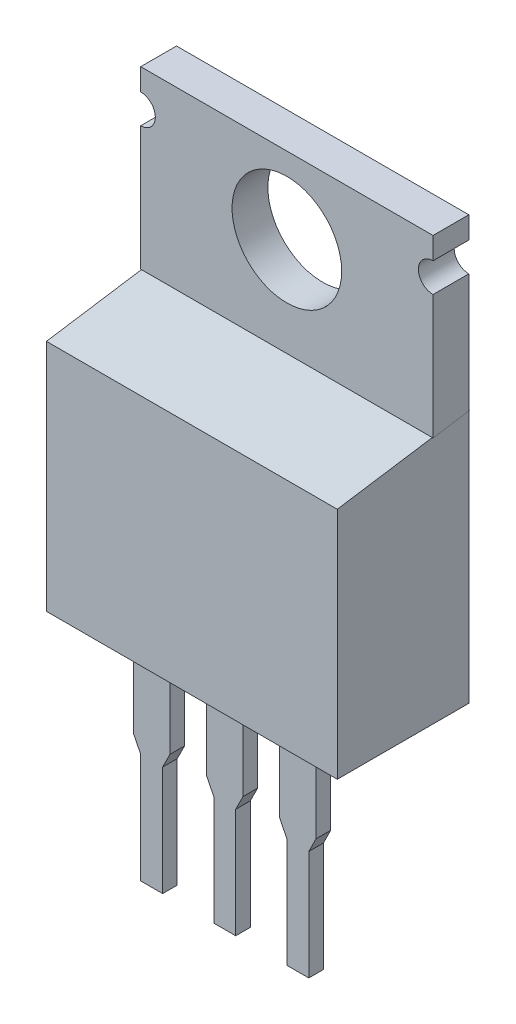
from build123d import *

# Parameters (mm, degrees)
SKETCH2_W                = 10.16
SKETCH2_H                = 4.572
BASE_EXTRUDE_DEPTH       = 14.732
CUT_EXTRUDE1_DEPTH       = 22.380177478
CUT_EXTRUDE1_DEPTH_BACK  = 22.380177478
SKETCH4_R                = 1.905
CUT_EXTRUDE2_DEPTH       = 14.732
CUT_EXTRUDE4_DEPTH       = 0.0254
CUT_EXTRUDE5_DEPTH       = 0.0254
CUT_EXTRUDE6_DEPTH       = 0.0254
CUT_EXTRUDE7_DEPTH       = 2.54
SKETCH9_W                = 1.27
SKETCH9_H                = 7.62
BOSS_EXTRUDE_THIN1_DEPTH = 0.254
CUT_EXTRUDE8_DEPTH       = 1.27
LPATTERN1_COUNT          = 3
LPATTERN1_PITCH          = 2.54


with BuildPart() as part:
    # Sketch2 → Base-Extrude (new body)
    with BuildSketch(Plane(origin=(0, 3.81, 0), x_dir=(-1, 0, 0), z_dir=(0, 1, 0))):
        with Locations((-2.54, -0.889)):
            Rectangle(SKETCH2_W, SKETCH2_H)
    extrude(amount=BASE_EXTRUDE_DEPTH)

    # Sketch3 → Cut-Extrude1 (cut, two sides: drawn at the far end of the back side and taken through both)
    with BuildSketch(Plane.ZY.offset(2.54).offset(-CUT_EXTRUDE1_DEPTH_BACK)):
        Polygon((-1.905, 18.542), (-1.905, 12.446), (1.397, 11.938), (1.397, 18.542), align=None)
    extrude(amount=CUT_EXTRUDE1_DEPTH + CUT_EXTRUDE1_DEPTH_BACK, mode=Mode.SUBTRACT)

    # Sketch4 → Cut-Extrude2 (cut)
    with BuildSketch(Plane.XY.offset(-1.905)):
        with Locations((2.54, 15.875)):
            Circle(SKETCH4_R)
    extrude(amount=-CUT_EXTRUDE2_DEPTH, mode=Mode.SUBTRACT)

    # Sketch5 → Cut-Extrude4 (cut)
    with BuildSketch(Plane.ZY.offset(2.54)):
        Polygon((-3.175, 12.641384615), (1.397, 11.938), (1.397, 3.81), (-3.175, 3.81), align=None)
    extrude(amount=-CUT_EXTRUDE4_DEPTH, mode=Mode.SUBTRACT)

    # Sketch6 → Cut-Extrude5 (cut)
    with BuildSketch(Plane(origin=(7.62, 0, 0), x_dir=(0, 0, -1), z_dir=(1, 0, 0))):
        Polygon((-1.397, 11.938), (3.175, 12.641384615), (3.175, 3.81), (-1.397, 3.81), align=None)
    extrude(amount=-CUT_EXTRUDE5_DEPTH, mode=Mode.SUBTRACT)

    # Sketch7 → Cut-Extrude6 (cut)
    with BuildSketch(Plane(origin=(0, 0, -3.175), x_dir=(-1, 0, 0), z_dir=(0, 0, -1))):
        Polygon((-7.62, 18.542), (-7.62, 12.641384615), (-6.35, 12.641384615), (-6.35, 7.112), (1.27, 7.112), (1.27, 12.641384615), (2.54, 12.641384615), (2.54, 18.542), align=None)
    extrude(amount=-CUT_EXTRUDE6_DEPTH, mode=Mode.SUBTRACT)

    # Sketch8 → Cut-Extrude7 (cut)
    with BuildSketch(Plane.XY.offset(-1.905)):
        with BuildLine():
            Line((7.62, 16.764), (7.62, 17.78))
            ThreePointArc((7.62, 17.78), (7.112, 17.272), (7.62, 16.764))
        make_face()
        with BuildLine():
            Line((-2.54, 16.764), (-2.54, 17.78))
            ThreePointArc((-2.54, 17.78), (-2.032, 17.272), (-2.54, 16.764))
        make_face()
    extrude(amount=-CUT_EXTRUDE7_DEPTH, mode=Mode.SUBTRACT)

    # Sketch9 → Boss-Extrude-Thin1 (add, symmetric)
    with BuildSketch(Plane.XY):
        Rectangle(SKETCH9_W, SKETCH9_H)
    boss_extrude_thin1 = extrude(amount=BOSS_EXTRUDE_THIN1_DEPTH, both=True)

    # Sketch11 → Cut-Extrude8 (cut)
    with BuildSketch(Plane.XY.offset(0.254)):
        Polygon((0.635, 0.508), (0.635, -3.81), (0.381, -3.81), (0.381, 0), align=None)
        Polygon((-0.635, 0.508), (-0.635, -3.81), (-0.381, -3.81), (-0.381, 0), align=None)
    cut_extrude8 = extrude(amount=-CUT_EXTRUDE8_DEPTH, mode=Mode.SUBTRACT)

    # LPattern1: Boss-Extrude-Thin1, Cut-Extrude8 ×3
    with Locations(*[(i * LPATTERN1_PITCH, 0, 0) for i in range(1, LPATTERN1_COUNT)]):
        add(boss_extrude_thin1)
        add(cut_extrude8, mode=Mode.SUBTRACT)


solid = part.part
